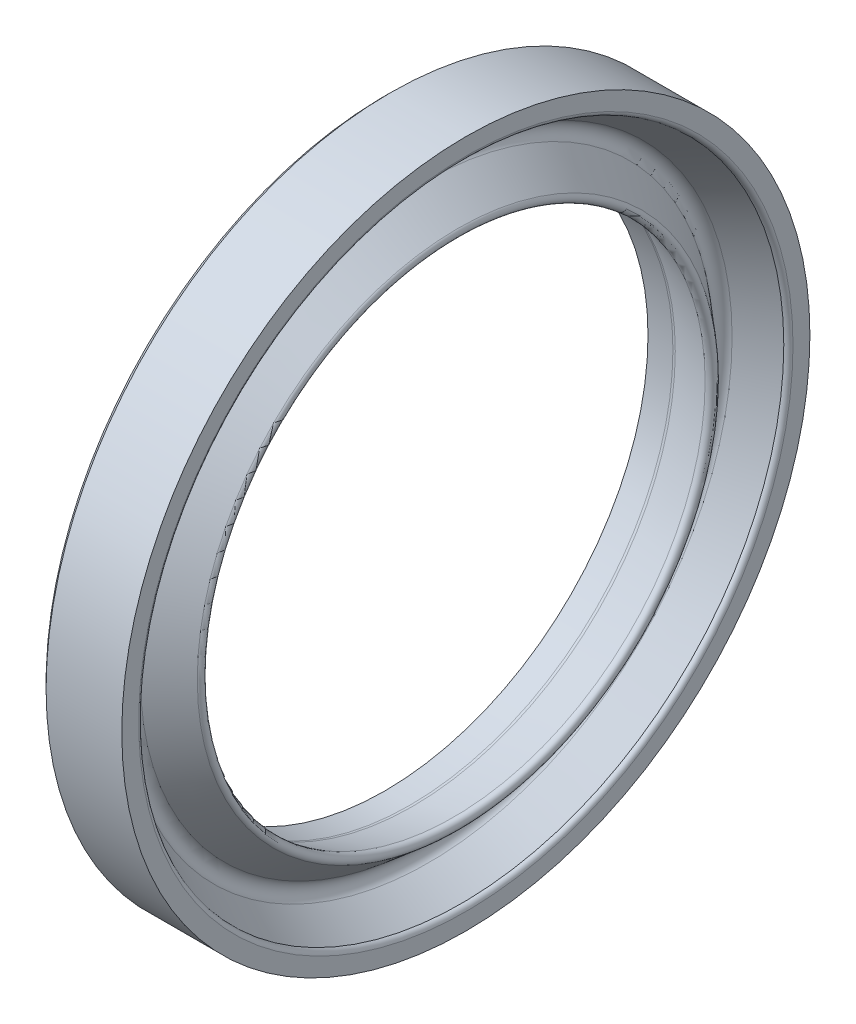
from build123d import *


with BuildPart() as part:
    # Esquisse2 → R_volution2 (revolve)
    with BuildSketch(Plane.XY, mode=Mode.PRIVATE) as r_volution2_sk:
        with BuildLine():
            Line((-9.1, -42.5), (-9.75, -41.85))
            Line((-9.75, -41.85), (-9.75, -32.5))
            Line((-9.75, -32.5), (-6.671148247, -32.5))
            ThreePointArc((-6.671148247, -32.5), (-6.501464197, -32.48887832), (-6.334683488, -32.455703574))
            Line((-6.334683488, -32.455703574), (-1.3, -31.106664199))
            ThreePointArc((-1.3, -31.106664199), (-0.587327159, -31.420247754), (-0.739226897, -32.183899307))
            Line((-0.739226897, -32.183899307), (-4.559729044, -35.389681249))
            ThreePointArc((-4.559729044, -35.389681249), (-5.019158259, -36.498841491), (-4.374105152, -37.51137205))
            Line((-4.374105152, -37.51137205), (-0.325, -39.849124))
            ThreePointArc((-0.325, -39.849124), (0.060078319, -40.030909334), (0.25, -40.412040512))
            Line((0.25, -40.412040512), (0.25, -42.5))
            Line((0.25, -42.5), (-9.1, -42.5))
        make_face()
    revolve(r_volution2_sk.sketch.rotate(Axis((2.43404063, 0, 0), (-1, 0, 0)), 270), axis=Axis((2.43404063, 0, 0), (-1, 0, 0)))


solid = part.part
